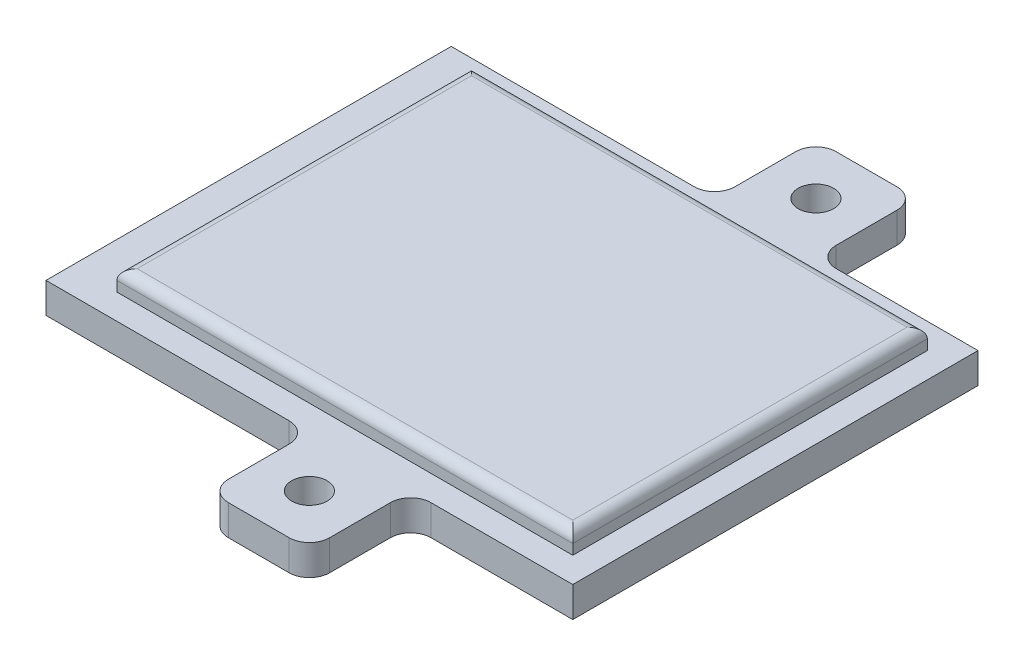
ISO-10303-21;
HEADER;
FILE_DESCRIPTION(('STEP AP214'),'2;1');
FILE_NAME('part.step','',(''),(''),'','','');
FILE_SCHEMA(('AUTOMOTIVE_DESIGN { 1 0 10303 214 1 1 1 1 }'));
ENDSEC;
DATA;
#1=APPLICATION_CONTEXT('core data for automotive mechanical design processes');
#2=APPLICATION_PROTOCOL_DEFINITION('international standard','automotive_design',2000,#1);
#3=PRODUCT_CONTEXT('',#1,'mechanical');
#4=PRODUCT('Part','Part','',(#3));
#5=PRODUCT_RELATED_PRODUCT_CATEGORY('part','',(#4));
#6=PRODUCT_DEFINITION_FORMATION('','',#4);
#7=PRODUCT_DEFINITION_CONTEXT('part definition',#1,'design');
#8=PRODUCT_DEFINITION('design','',#6,#7);
#9=PRODUCT_DEFINITION_SHAPE('','',#8);
#10=(LENGTH_UNIT() NAMED_UNIT(*) SI_UNIT(.MILLI.,.METRE.));
#11=(NAMED_UNIT(*) PLANE_ANGLE_UNIT() SI_UNIT($,.RADIAN.));
#12=(NAMED_UNIT(*) SI_UNIT($,.STERADIAN.) SOLID_ANGLE_UNIT());
#13=UNCERTAINTY_MEASURE_WITH_UNIT(LENGTH_MEASURE(1.E-05),#10,'distance_accuracy_value','');
#14=(GEOMETRIC_REPRESENTATION_CONTEXT(3) GLOBAL_UNCERTAINTY_ASSIGNED_CONTEXT((#13)) GLOBAL_UNIT_ASSIGNED_CONTEXT((#10,
#11,#12)) REPRESENTATION_CONTEXT('',''));
#15=CARTESIAN_POINT('',(0.,0.,0.));
#16=DIRECTION('',(0.,0.,1.));
#17=DIRECTION('',(1.,0.,0.));
#18=AXIS2_PLACEMENT_3D('',#15,#16,#17);
#19=CARTESIAN_POINT('',(0.,3.,0.));
#20=DIRECTION('',(0.,-1.,0.));
#21=DIRECTION('',(0.,0.,-1.));
#22=AXIS2_PLACEMENT_3D('',#19,#20,#21);
#23=PLANE('',#22);
#24=CARTESIAN_POINT('',(-21.,3.,-45.));
#25=DIRECTION('',(0.,1.,0.));
#26=DIRECTION('',(0.,0.,1.));
#27=AXIS2_PLACEMENT_3D('',#24,#25,#26);
#28=CIRCLE('',#27,1.75);
#29=CARTESIAN_POINT('',(-21.,3.,-43.25));
#30=VERTEX_POINT('',#29);
#31=EDGE_CURVE('E798',#30,#30,#28,.T.);
#32=ORIENTED_EDGE('',*,*,#31,.F.);
#33=EDGE_LOOP('',(#32));
#34=FACE_BOUND('',#33,.T.);
#35=CARTESIAN_POINT('',(-21.,3.,5.));
#36=DIRECTION('',(0.,1.,0.));
#37=DIRECTION('',(0.,0.,1.));
#38=AXIS2_PLACEMENT_3D('',#35,#36,#37);
#39=CIRCLE('',#38,1.75);
#40=CARTESIAN_POINT('',(-21.,3.,6.75));
#41=VERTEX_POINT('',#40);
#42=EDGE_CURVE('E797',#41,#41,#39,.T.);
#43=ORIENTED_EDGE('',*,*,#42,.F.);
#44=EDGE_LOOP('',(#43));
#45=FACE_BOUND('',#44,.T.);
#46=DIRECTION('',(0.,0.,-1.));
#47=VECTOR('',#46,1.);
#48=CARTESIAN_POINT('',(-16.,3.,-40.));
#49=LINE('',#48,#47);
#50=CARTESIAN_POINT('',(-16.,3.,-42.));
#51=VERTEX_POINT('',#50);
#52=CARTESIAN_POINT('',(-16.,3.,-48.));
#53=VERTEX_POINT('',#52);
#54=EDGE_CURVE('E288',#51,#53,#49,.T.);
#55=ORIENTED_EDGE('',*,*,#54,.T.);
#56=CARTESIAN_POINT('',(-18.,3.,-48.));
#57=DIRECTION('',(0.,-1.,0.));
#58=DIRECTION('',(0.,0.,-1.));
#59=AXIS2_PLACEMENT_3D('',#56,#57,#58);
#60=CIRCLE('',#59,2.);
#61=CARTESIAN_POINT('',(-18.,3.,-50.));
#62=VERTEX_POINT('',#61);
#63=EDGE_CURVE('E369',#53,#62,#60,.F.);
#64=ORIENTED_EDGE('',*,*,#63,.T.);
#65=DIRECTION('',(1.,0.,0.));
#66=VECTOR('',#65,1.);
#67=CARTESIAN_POINT('',(-26.,3.,-50.));
#68=LINE('',#67,#66);
#69=CARTESIAN_POINT('',(-24.,3.,-50.));
#70=VERTEX_POINT('',#69);
#71=EDGE_CURVE('E285',#70,#62,#68,.T.);
#72=ORIENTED_EDGE('',*,*,#71,.F.);
#73=CARTESIAN_POINT('',(-24.,3.,-48.));
#74=DIRECTION('',(0.,-1.,0.));
#75=DIRECTION('',(0.,0.,-1.));
#76=AXIS2_PLACEMENT_3D('',#73,#74,#75);
#77=CIRCLE('',#76,2.);
#78=CARTESIAN_POINT('',(-26.,3.,-48.));
#79=VERTEX_POINT('',#78);
#80=EDGE_CURVE('E367',#70,#79,#77,.F.);
#81=ORIENTED_EDGE('',*,*,#80,.T.);
#82=DIRECTION('',(0.,0.,-1.));
#83=VECTOR('',#82,1.);
#84=CARTESIAN_POINT('',(-26.,3.,-40.));
#85=LINE('',#84,#83);
#86=CARTESIAN_POINT('',(-26.,3.,-42.));
#87=VERTEX_POINT('',#86);
#88=EDGE_CURVE('E292',#87,#79,#85,.T.);
#89=ORIENTED_EDGE('',*,*,#88,.F.);
#90=CARTESIAN_POINT('',(-28.,3.,-42.));
#91=DIRECTION('',(0.,-1.,0.));
#92=DIRECTION('',(0.,0.,-1.));
#93=AXIS2_PLACEMENT_3D('',#90,#91,#92);
#94=CIRCLE('',#93,2.);
#95=CARTESIAN_POINT('',(-28.,3.,-40.));
#96=VERTEX_POINT('',#95);
#97=EDGE_CURVE('E405',#87,#96,#94,.T.);
#98=ORIENTED_EDGE('',*,*,#97,.T.);
#99=DIRECTION('',(-1.,0.,0.));
#100=VECTOR('',#99,1.);
#101=CARTESIAN_POINT('',(0.,3.,-40.));
#102=LINE('',#101,#100);
#103=CARTESIAN_POINT('',(-52.,3.,-40.));
#104=VERTEX_POINT('',#103);
#105=EDGE_CURVE('E252',#96,#104,#102,.T.);
#106=ORIENTED_EDGE('',*,*,#105,.T.);
#107=DIRECTION('',(0.,0.,-1.));
#108=VECTOR('',#107,1.);
#109=CARTESIAN_POINT('',(-52.,3.,0.));
#110=LINE('',#109,#108);
#111=CARTESIAN_POINT('',(-52.,3.,0.));
#112=VERTEX_POINT('',#111);
#113=EDGE_CURVE('E251',#112,#104,#110,.T.);
#114=ORIENTED_EDGE('',*,*,#113,.F.);
#115=DIRECTION('',(-1.,0.,0.));
#116=VECTOR('',#115,1.);
#117=CARTESIAN_POINT('',(0.,3.,0.));
#118=LINE('',#117,#116);
#119=CARTESIAN_POINT('',(-28.,3.,0.));
#120=VERTEX_POINT('',#119);
#121=EDGE_CURVE('E255',#120,#112,#118,.T.);
#122=ORIENTED_EDGE('',*,*,#121,.F.);
#123=CARTESIAN_POINT('',(-28.,3.,2.));
#124=DIRECTION('',(0.,-1.,0.));
#125=DIRECTION('',(0.,0.,-1.));
#126=AXIS2_PLACEMENT_3D('',#123,#124,#125);
#127=CIRCLE('',#126,2.);
#128=CARTESIAN_POINT('',(-26.,3.,2.));
#129=VERTEX_POINT('',#128);
#130=EDGE_CURVE('E409',#120,#129,#127,.T.);
#131=ORIENTED_EDGE('',*,*,#130,.T.);
#132=DIRECTION('',(0.,0.,1.));
#133=VECTOR('',#132,1.);
#134=CARTESIAN_POINT('',(-26.,3.,0.));
#135=LINE('',#134,#133);
#136=CARTESIAN_POINT('',(-26.,3.,8.));
#137=VERTEX_POINT('',#136);
#138=EDGE_CURVE('E299',#129,#137,#135,.T.);
#139=ORIENTED_EDGE('',*,*,#138,.T.);
#140=CARTESIAN_POINT('',(-24.,3.,8.));
#141=DIRECTION('',(0.,-1.,0.));
#142=DIRECTION('',(0.,0.,-1.));
#143=AXIS2_PLACEMENT_3D('',#140,#141,#142);
#144=CIRCLE('',#143,2.);
#145=CARTESIAN_POINT('',(-24.,3.,10.));
#146=VERTEX_POINT('',#145);
#147=EDGE_CURVE('E365',#137,#146,#144,.F.);
#148=ORIENTED_EDGE('',*,*,#147,.T.);
#149=DIRECTION('',(1.,0.,0.));
#150=VECTOR('',#149,1.);
#151=CARTESIAN_POINT('',(-26.,3.,10.));
#152=LINE('',#151,#150);
#153=CARTESIAN_POINT('',(-18.,3.,10.));
#154=VERTEX_POINT('',#153);
#155=EDGE_CURVE('E304',#146,#154,#152,.T.);
#156=ORIENTED_EDGE('',*,*,#155,.T.);
#157=CARTESIAN_POINT('',(-18.,3.,8.));
#158=DIRECTION('',(0.,-1.,0.));
#159=DIRECTION('',(0.,0.,-1.));
#160=AXIS2_PLACEMENT_3D('',#157,#158,#159);
#161=CIRCLE('',#160,2.);
#162=CARTESIAN_POINT('',(-16.,3.,8.));
#163=VERTEX_POINT('',#162);
#164=EDGE_CURVE('E58',#154,#163,#161,.F.);
#165=ORIENTED_EDGE('',*,*,#164,.T.);
#166=DIRECTION('',(0.,0.,1.));
#167=VECTOR('',#166,1.);
#168=CARTESIAN_POINT('',(-16.,3.,0.));
#169=LINE('',#168,#167);
#170=CARTESIAN_POINT('',(-16.,3.,2.));
#171=VERTEX_POINT('',#170);
#172=EDGE_CURVE('E306',#171,#163,#169,.T.);
#173=ORIENTED_EDGE('',*,*,#172,.F.);
#174=CARTESIAN_POINT('',(-14.,3.,2.));
#175=DIRECTION('',(0.,-1.,0.));
#176=DIRECTION('',(0.,0.,-1.));
#177=AXIS2_PLACEMENT_3D('',#174,#175,#176);
#178=CIRCLE('',#177,2.);
#179=CARTESIAN_POINT('',(-14.,3.,0.));
#180=VERTEX_POINT('',#179);
#181=EDGE_CURVE('E11',#171,#180,#178,.T.);
#182=ORIENTED_EDGE('',*,*,#181,.T.);
#183=CARTESIAN_POINT('',(0.,3.,0.));
#184=VERTEX_POINT('',#183);
#185=EDGE_CURVE('E256',#184,#180,#118,.T.);
#186=ORIENTED_EDGE('',*,*,#185,.F.);
#187=DIRECTION('',(0.,0.,-1.));
#188=VECTOR('',#187,1.);
#189=CARTESIAN_POINT('',(0.,3.,0.));
#190=LINE('',#189,#188);
#191=CARTESIAN_POINT('',(0.,3.,-40.));
#192=VERTEX_POINT('',#191);
#193=EDGE_CURVE('E258',#184,#192,#190,.T.);
#194=ORIENTED_EDGE('',*,*,#193,.T.);
#195=CARTESIAN_POINT('',(-14.,3.,-40.));
#196=VERTEX_POINT('',#195);
#197=EDGE_CURVE('E248',#192,#196,#102,.T.);
#198=ORIENTED_EDGE('',*,*,#197,.T.);
#199=CARTESIAN_POINT('',(-14.,3.,-42.));
#200=DIRECTION('',(0.,-1.,0.));
#201=DIRECTION('',(0.,0.,-1.));
#202=AXIS2_PLACEMENT_3D('',#199,#200,#201);
#203=CIRCLE('',#202,2.);
#204=EDGE_CURVE('E401',#196,#51,#203,.T.);
#205=ORIENTED_EDGE('',*,*,#204,.T.);
#206=EDGE_LOOP('',(#55,#64,#72,#81,#89,#98,#106,#114,#122,#131,#139,#148,#156,#165,#173,#182,
#186,#194,#198,#205));
#207=FACE_BOUND('',#206,.T.);
#208=DIRECTION('',(0.,0.,-1.));
#209=VECTOR('',#208,1.);
#210=CARTESIAN_POINT('',(-2.5,3.,-37.5));
#211=LINE('',#210,#209);
#212=CARTESIAN_POINT('',(-2.5,3.,-2.5));
#213=VERTEX_POINT('',#212);
#214=CARTESIAN_POINT('',(-2.5,3.,-37.5));
#215=VERTEX_POINT('',#214);
#216=EDGE_CURVE('E236',#213,#215,#211,.T.);
#217=ORIENTED_EDGE('',*,*,#216,.F.);
#218=DIRECTION('',(1.,0.,0.));
#219=VECTOR('',#218,1.);
#220=CARTESIAN_POINT('',(-2.5,3.,-2.5));
#221=LINE('',#220,#219);
#222=CARTESIAN_POINT('',(-47.5,3.,-2.5));
#223=VERTEX_POINT('',#222);
#224=EDGE_CURVE('E232',#223,#213,#221,.T.);
#225=ORIENTED_EDGE('',*,*,#224,.F.);
#226=DIRECTION('',(0.,0.,1.));
#227=VECTOR('',#226,1.);
#228=CARTESIAN_POINT('',(-47.5,3.,-37.5));
#229=LINE('',#228,#227);
#230=CARTESIAN_POINT('',(-47.5,3.,-37.5));
#231=VERTEX_POINT('',#230);
#232=EDGE_CURVE('E216',#231,#223,#229,.T.);
#233=ORIENTED_EDGE('',*,*,#232,.F.);
#234=DIRECTION('',(-1.,0.,0.));
#235=VECTOR('',#234,1.);
#236=CARTESIAN_POINT('',(-2.5,3.,-37.5));
#237=LINE('',#236,#235);
#238=EDGE_CURVE('E229',#215,#231,#237,.T.);
#239=ORIENTED_EDGE('',*,*,#238,.F.);
#240=EDGE_LOOP('',(#217,#225,#233,#239));
#241=FACE_BOUND('',#240,.T.);
#242=ADVANCED_FACE('F39',(#34,#45,#207,#241),#23,.F.);
#243=CARTESIAN_POINT('',(-52.,3.,0.));
#244=DIRECTION('',(-1.,0.,0.));
#245=DIRECTION('',(0.,0.,1.));
#246=AXIS2_PLACEMENT_3D('',#243,#244,#245);
#247=PLANE('',#246);
#248=DIRECTION('',(0.,0.,-1.));
#249=VECTOR('',#248,1.);
#250=CARTESIAN_POINT('',(-52.,0.,0.));
#251=LINE('',#250,#249);
#252=CARTESIAN_POINT('',(-52.,0.,0.));
#253=VERTEX_POINT('',#252);
#254=CARTESIAN_POINT('',(-52.,0.,-40.));
#255=VERTEX_POINT('',#254);
#256=EDGE_CURVE('E264',#253,#255,#251,.T.);
#257=ORIENTED_EDGE('',*,*,#256,.F.);
#258=DIRECTION('',(0.,-1.,0.));
#259=VECTOR('',#258,1.);
#260=CARTESIAN_POINT('',(-52.,3.,0.));
#261=LINE('',#260,#259);
#262=EDGE_CURVE('E278',#112,#253,#261,.T.);
#263=ORIENTED_EDGE('',*,*,#262,.F.);
#264=ORIENTED_EDGE('',*,*,#113,.T.);
#265=DIRECTION('',(0.,-1.,0.));
#266=VECTOR('',#265,1.);
#267=CARTESIAN_POINT('',(-52.,3.,-40.));
#268=LINE('',#267,#266);
#269=EDGE_CURVE('E281',#104,#255,#268,.T.);
#270=ORIENTED_EDGE('',*,*,#269,.T.);
#271=EDGE_LOOP('',(#257,#263,#264,#270));
#272=FACE_BOUND('',#271,.T.);
#273=ADVANCED_FACE('F472',(#272),#247,.T.);
#274=CARTESIAN_POINT('',(0.,3.,0.));
#275=DIRECTION('',(-1.,0.,0.));
#276=DIRECTION('',(0.,0.,1.));
#277=AXIS2_PLACEMENT_3D('',#274,#275,#276);
#278=PLANE('',#277);
#279=DIRECTION('',(0.,0.,-1.));
#280=VECTOR('',#279,1.);
#281=CARTESIAN_POINT('',(0.,0.,0.));
#282=LINE('',#281,#280);
#283=CARTESIAN_POINT('',(0.,0.,0.));
#284=VERTEX_POINT('',#283);
#285=CARTESIAN_POINT('',(0.,0.,-40.));
#286=VERTEX_POINT('',#285);
#287=EDGE_CURVE('E272',#284,#286,#282,.T.);
#288=ORIENTED_EDGE('',*,*,#287,.T.);
#289=DIRECTION('',(0.,-1.,0.));
#290=VECTOR('',#289,1.);
#291=CARTESIAN_POINT('',(0.,3.,-40.));
#292=LINE('',#291,#290);
#293=EDGE_CURVE('E260',#192,#286,#292,.T.);
#294=ORIENTED_EDGE('',*,*,#293,.F.);
#295=ORIENTED_EDGE('',*,*,#193,.F.);
#296=DIRECTION('',(0.,-1.,0.));
#297=VECTOR('',#296,1.);
#298=CARTESIAN_POINT('',(0.,3.,0.));
#299=LINE('',#298,#297);
#300=EDGE_CURVE('E276',#184,#284,#299,.T.);
#301=ORIENTED_EDGE('',*,*,#300,.T.);
#302=EDGE_LOOP('',(#288,#294,#295,#301));
#303=FACE_BOUND('',#302,.T.);
#304=ADVANCED_FACE('F428',(#303),#278,.F.);
#305=CARTESIAN_POINT('',(0.,0.,0.));
#306=DIRECTION('',(0.,-1.,0.));
#307=DIRECTION('',(0.,0.,-1.));
#308=AXIS2_PLACEMENT_3D('',#305,#306,#307);
#309=PLANE('',#308);
#310=CARTESIAN_POINT('',(-21.,0.,-45.));
#311=DIRECTION('',(0.,1.,0.));
#312=DIRECTION('',(0.,0.,1.));
#313=AXIS2_PLACEMENT_3D('',#310,#311,#312);
#314=CIRCLE('',#313,1.75);
#315=CARTESIAN_POINT('',(-21.,0.,-43.25));
#316=VERTEX_POINT('',#315);
#317=EDGE_CURVE('E338',#316,#316,#314,.T.);
#318=ORIENTED_EDGE('',*,*,#317,.T.);
#319=EDGE_LOOP('',(#318));
#320=FACE_BOUND('',#319,.T.);
#321=CARTESIAN_POINT('',(-21.,0.,5.));
#322=DIRECTION('',(0.,1.,0.));
#323=DIRECTION('',(0.,0.,1.));
#324=AXIS2_PLACEMENT_3D('',#321,#322,#323);
#325=CIRCLE('',#324,1.75);
#326=CARTESIAN_POINT('',(-21.,0.,6.75));
#327=VERTEX_POINT('',#326);
#328=EDGE_CURVE('E794',#327,#327,#325,.T.);
#329=ORIENTED_EDGE('',*,*,#328,.T.);
#330=EDGE_LOOP('',(#329));
#331=FACE_BOUND('',#330,.T.);
#332=DIRECTION('',(1.,0.,0.));
#333=VECTOR('',#332,1.);
#334=CARTESIAN_POINT('',(-26.,0.,-50.));
#335=LINE('',#334,#333);
#336=CARTESIAN_POINT('',(-24.,0.,-50.));
#337=VERTEX_POINT('',#336);
#338=CARTESIAN_POINT('',(-18.,0.,-50.));
#339=VERTEX_POINT('',#338);
#340=EDGE_CURVE('E295',#337,#339,#335,.T.);
#341=ORIENTED_EDGE('',*,*,#340,.T.);
#342=CARTESIAN_POINT('',(-18.,0.,-48.));
#343=DIRECTION('',(0.,-1.,0.));
#344=DIRECTION('',(0.,0.,-1.));
#345=AXIS2_PLACEMENT_3D('',#342,#343,#344);
#346=CIRCLE('',#345,2.);
#347=CARTESIAN_POINT('',(-16.,0.,-48.));
#348=VERTEX_POINT('',#347);
#349=EDGE_CURVE('E362',#339,#348,#346,.T.);
#350=ORIENTED_EDGE('',*,*,#349,.T.);
#351=DIRECTION('',(0.,0.,-1.));
#352=VECTOR('',#351,1.);
#353=CARTESIAN_POINT('',(-16.,0.,-40.));
#354=LINE('',#353,#352);
#355=CARTESIAN_POINT('',(-16.,0.,-42.));
#356=VERTEX_POINT('',#355);
#357=EDGE_CURVE('E298',#356,#348,#354,.T.);
#358=ORIENTED_EDGE('',*,*,#357,.F.);
#359=CARTESIAN_POINT('',(-14.,0.,-42.));
#360=DIRECTION('',(0.,-1.,0.));
#361=DIRECTION('',(0.,0.,-1.));
#362=AXIS2_PLACEMENT_3D('',#359,#360,#361);
#363=CIRCLE('',#362,2.);
#364=CARTESIAN_POINT('',(-14.,0.,-40.));
#365=VERTEX_POINT('',#364);
#366=EDGE_CURVE('E399',#356,#365,#363,.F.);
#367=ORIENTED_EDGE('',*,*,#366,.T.);
#368=DIRECTION('',(-1.,0.,0.));
#369=VECTOR('',#368,1.);
#370=CARTESIAN_POINT('',(0.,0.,-40.));
#371=LINE('',#370,#369);
#372=EDGE_CURVE('E261',#286,#365,#371,.T.);
#373=ORIENTED_EDGE('',*,*,#372,.F.);
#374=ORIENTED_EDGE('',*,*,#287,.F.);
#375=DIRECTION('',(-1.,0.,0.));
#376=VECTOR('',#375,1.);
#377=CARTESIAN_POINT('',(0.,0.,0.));
#378=LINE('',#377,#376);
#379=CARTESIAN_POINT('',(-14.,0.,0.));
#380=VERTEX_POINT('',#379);
#381=EDGE_CURVE('E269',#284,#380,#378,.T.);
#382=ORIENTED_EDGE('',*,*,#381,.T.);
#383=CARTESIAN_POINT('',(-14.,0.,2.));
#384=DIRECTION('',(0.,-1.,0.));
#385=DIRECTION('',(0.,0.,-1.));
#386=AXIS2_PLACEMENT_3D('',#383,#384,#385);
#387=CIRCLE('',#386,2.);
#388=CARTESIAN_POINT('',(-16.,0.,2.));
#389=VERTEX_POINT('',#388);
#390=EDGE_CURVE('E47',#380,#389,#387,.F.);
#391=ORIENTED_EDGE('',*,*,#390,.T.);
#392=DIRECTION('',(0.,0.,1.));
#393=VECTOR('',#392,1.);
#394=CARTESIAN_POINT('',(-16.,0.,0.));
#395=LINE('',#394,#393);
#396=CARTESIAN_POINT('',(-16.,0.,8.));
#397=VERTEX_POINT('',#396);
#398=EDGE_CURVE('E313',#389,#397,#395,.T.);
#399=ORIENTED_EDGE('',*,*,#398,.T.);
#400=CARTESIAN_POINT('',(-18.,0.,8.));
#401=DIRECTION('',(0.,-1.,0.));
#402=DIRECTION('',(0.,0.,-1.));
#403=AXIS2_PLACEMENT_3D('',#400,#401,#402);
#404=CIRCLE('',#403,2.);
#405=CARTESIAN_POINT('',(-18.,0.,10.));
#406=VERTEX_POINT('',#405);
#407=EDGE_CURVE('E356',#397,#406,#404,.T.);
#408=ORIENTED_EDGE('',*,*,#407,.T.);
#409=DIRECTION('',(1.,0.,0.));
#410=VECTOR('',#409,1.);
#411=CARTESIAN_POINT('',(-26.,0.,10.));
#412=LINE('',#411,#410);
#413=CARTESIAN_POINT('',(-24.,0.,10.));
#414=VERTEX_POINT('',#413);
#415=EDGE_CURVE('E247',#414,#406,#412,.T.);
#416=ORIENTED_EDGE('',*,*,#415,.F.);
#417=CARTESIAN_POINT('',(-24.,0.,8.));
#418=DIRECTION('',(0.,-1.,0.));
#419=DIRECTION('',(0.,0.,-1.));
#420=AXIS2_PLACEMENT_3D('',#417,#418,#419);
#421=CIRCLE('',#420,2.);
#422=CARTESIAN_POINT('',(-26.,0.,8.));
#423=VERTEX_POINT('',#422);
#424=EDGE_CURVE('E358',#414,#423,#421,.T.);
#425=ORIENTED_EDGE('',*,*,#424,.T.);
#426=DIRECTION('',(0.,0.,1.));
#427=VECTOR('',#426,1.);
#428=CARTESIAN_POINT('',(-26.,0.,0.));
#429=LINE('',#428,#427);
#430=CARTESIAN_POINT('',(-26.,0.,2.));
#431=VERTEX_POINT('',#430);
#432=EDGE_CURVE('E307',#431,#423,#429,.T.);
#433=ORIENTED_EDGE('',*,*,#432,.F.);
#434=CARTESIAN_POINT('',(-28.,0.,2.));
#435=DIRECTION('',(0.,-1.,0.));
#436=DIRECTION('',(0.,0.,-1.));
#437=AXIS2_PLACEMENT_3D('',#434,#435,#436);
#438=CIRCLE('',#437,2.);
#439=CARTESIAN_POINT('',(-28.,0.,0.));
#440=VERTEX_POINT('',#439);
#441=EDGE_CURVE('E407',#431,#440,#438,.F.);
#442=ORIENTED_EDGE('',*,*,#441,.T.);
#443=EDGE_CURVE('E268',#440,#253,#378,.T.);
#444=ORIENTED_EDGE('',*,*,#443,.T.);
#445=ORIENTED_EDGE('',*,*,#256,.T.);
#446=CARTESIAN_POINT('',(-28.,0.,-40.));
#447=VERTEX_POINT('',#446);
#448=EDGE_CURVE('E265',#447,#255,#371,.T.);
#449=ORIENTED_EDGE('',*,*,#448,.F.);
#450=CARTESIAN_POINT('',(-28.,0.,-42.));
#451=DIRECTION('',(0.,-1.,0.));
#452=DIRECTION('',(0.,0.,-1.));
#453=AXIS2_PLACEMENT_3D('',#450,#451,#452);
#454=CIRCLE('',#453,2.);
#455=CARTESIAN_POINT('',(-26.,0.,-42.));
#456=VERTEX_POINT('',#455);
#457=EDGE_CURVE('E403',#447,#456,#454,.F.);
#458=ORIENTED_EDGE('',*,*,#457,.T.);
#459=DIRECTION('',(0.,0.,-1.));
#460=VECTOR('',#459,1.);
#461=CARTESIAN_POINT('',(-26.,0.,-40.));
#462=LINE('',#461,#460);
#463=CARTESIAN_POINT('',(-26.,0.,-48.));
#464=VERTEX_POINT('',#463);
#465=EDGE_CURVE('E289',#456,#464,#462,.T.);
#466=ORIENTED_EDGE('',*,*,#465,.T.);
#467=CARTESIAN_POINT('',(-24.,0.,-48.));
#468=DIRECTION('',(0.,-1.,0.));
#469=DIRECTION('',(0.,0.,-1.));
#470=AXIS2_PLACEMENT_3D('',#467,#468,#469);
#471=CIRCLE('',#470,2.);
#472=EDGE_CURVE('E360',#464,#337,#471,.T.);
#473=ORIENTED_EDGE('',*,*,#472,.T.);
#474=EDGE_LOOP('',(#341,#350,#358,#367,#373,#374,#382,#391,#399,#408,#416,#425,#433,#442,#444,
#445,#449,#458,#466,#473));
#475=FACE_BOUND('',#474,.T.);
#476=ADVANCED_FACE('F412',(#320,#331,#475),#309,.T.);
#477=CARTESIAN_POINT('',(0.,3.,0.));
#478=DIRECTION('',(0.,0.,1.));
#479=DIRECTION('',(1.,0.,0.));
#480=AXIS2_PLACEMENT_3D('',#477,#478,#479);
#481=PLANE('',#480);
#482=ORIENTED_EDGE('',*,*,#185,.T.);
#483=DIRECTION('',(0.,-1.,0.));
#484=VECTOR('',#483,1.);
#485=CARTESIAN_POINT('',(-14.,0.,0.));
#486=LINE('',#485,#484);
#487=EDGE_CURVE('E396',#180,#380,#486,.T.);
#488=ORIENTED_EDGE('',*,*,#487,.T.);
#489=ORIENTED_EDGE('',*,*,#381,.F.);
#490=ORIENTED_EDGE('',*,*,#300,.F.);
#491=EDGE_LOOP('',(#482,#488,#489,#490));
#492=FACE_BOUND('',#491,.T.);
#493=ADVANCED_FACE('F422',(#492),#481,.T.);
#494=ORIENTED_EDGE('',*,*,#443,.F.);
#495=DIRECTION('',(0.,-1.,0.));
#496=VECTOR('',#495,1.);
#497=CARTESIAN_POINT('',(-28.,3.,0.));
#498=LINE('',#497,#496);
#499=EDGE_CURVE('E389',#440,#120,#498,.F.);
#500=ORIENTED_EDGE('',*,*,#499,.T.);
#501=ORIENTED_EDGE('',*,*,#121,.T.);
#502=ORIENTED_EDGE('',*,*,#262,.T.);
#503=EDGE_LOOP('',(#494,#500,#501,#502));
#504=FACE_BOUND('',#503,.T.);
#505=ADVANCED_FACE('F522',(#504),#481,.T.);
#506=CARTESIAN_POINT('',(0.,3.,-40.));
#507=DIRECTION('',(0.,0.,1.));
#508=DIRECTION('',(1.,0.,0.));
#509=AXIS2_PLACEMENT_3D('',#506,#507,#508);
#510=PLANE('',#509);
#511=ORIENTED_EDGE('',*,*,#105,.F.);
#512=DIRECTION('',(0.,-1.,0.));
#513=VECTOR('',#512,1.);
#514=CARTESIAN_POINT('',(-28.,3.,-40.));
#515=LINE('',#514,#513);
#516=EDGE_CURVE('E376',#96,#447,#515,.T.);
#517=ORIENTED_EDGE('',*,*,#516,.T.);
#518=ORIENTED_EDGE('',*,*,#448,.T.);
#519=ORIENTED_EDGE('',*,*,#269,.F.);
#520=EDGE_LOOP('',(#511,#517,#518,#519));
#521=FACE_BOUND('',#520,.T.);
#522=ADVANCED_FACE('F467',(#521),#510,.F.);
#523=ORIENTED_EDGE('',*,*,#372,.T.);
#524=DIRECTION('',(0.,-1.,0.));
#525=VECTOR('',#524,1.);
#526=CARTESIAN_POINT('',(-14.,3.,-40.));
#527=LINE('',#526,#525);
#528=EDGE_CURVE('E349',#365,#196,#527,.F.);
#529=ORIENTED_EDGE('',*,*,#528,.T.);
#530=ORIENTED_EDGE('',*,*,#197,.F.);
#531=ORIENTED_EDGE('',*,*,#293,.T.);
#532=EDGE_LOOP('',(#523,#529,#530,#531));
#533=FACE_BOUND('',#532,.T.);
#534=ADVANCED_FACE('F431',(#533),#510,.F.);
#535=CARTESIAN_POINT('',(-26.,3.,10.));
#536=DIRECTION('',(0.,0.,-1.));
#537=DIRECTION('',(-1.,0.,0.));
#538=AXIS2_PLACEMENT_3D('',#535,#536,#537);
#539=PLANE('',#538);
#540=ORIENTED_EDGE('',*,*,#155,.F.);
#541=DIRECTION('',(0.,-1.,0.));
#542=VECTOR('',#541,1.);
#543=CARTESIAN_POINT('',(-24.,3.,10.));
#544=LINE('',#543,#542);
#545=EDGE_CURVE('E381',#146,#414,#544,.T.);
#546=ORIENTED_EDGE('',*,*,#545,.T.);
#547=ORIENTED_EDGE('',*,*,#415,.T.);
#548=DIRECTION('',(0.,-1.,0.));
#549=VECTOR('',#548,1.);
#550=CARTESIAN_POINT('',(-18.,3.,10.));
#551=LINE('',#550,#549);
#552=EDGE_CURVE('E379',#406,#154,#551,.F.);
#553=ORIENTED_EDGE('',*,*,#552,.T.);
#554=EDGE_LOOP('',(#540,#546,#547,#553));
#555=FACE_BOUND('',#554,.T.);
#556=ADVANCED_FACE('F493',(#555),#539,.F.);
#557=CARTESIAN_POINT('',(-16.,3.,0.));
#558=DIRECTION('',(1.,0.,0.));
#559=DIRECTION('',(0.,0.,-1.));
#560=AXIS2_PLACEMENT_3D('',#557,#558,#559);
#561=PLANE('',#560);
#562=ORIENTED_EDGE('',*,*,#172,.T.);
#563=DIRECTION('',(0.,-1.,0.));
#564=VECTOR('',#563,1.);
#565=CARTESIAN_POINT('',(-16.,0.,8.));
#566=LINE('',#565,#564);
#567=EDGE_CURVE('E393',#163,#397,#566,.T.);
#568=ORIENTED_EDGE('',*,*,#567,.T.);
#569=ORIENTED_EDGE('',*,*,#398,.F.);
#570=DIRECTION('',(0.,-1.,0.));
#571=VECTOR('',#570,1.);
#572=CARTESIAN_POINT('',(-16.,3.,2.));
#573=LINE('',#572,#571);
#574=EDGE_CURVE('E391',#389,#171,#573,.F.);
#575=ORIENTED_EDGE('',*,*,#574,.T.);
#576=EDGE_LOOP('',(#562,#568,#569,#575));
#577=FACE_BOUND('',#576,.T.);
#578=ADVANCED_FACE('F419',(#577),#561,.T.);
#579=CARTESIAN_POINT('',(-26.,3.,0.));
#580=DIRECTION('',(1.,0.,0.));
#581=DIRECTION('',(0.,0.,-1.));
#582=AXIS2_PLACEMENT_3D('',#579,#580,#581);
#583=PLANE('',#582);
#584=ORIENTED_EDGE('',*,*,#432,.T.);
#585=DIRECTION('',(0.,-1.,0.));
#586=VECTOR('',#585,1.);
#587=CARTESIAN_POINT('',(-26.,3.,8.));
#588=LINE('',#587,#586);
#589=EDGE_CURVE('E387',#423,#137,#588,.F.);
#590=ORIENTED_EDGE('',*,*,#589,.T.);
#591=ORIENTED_EDGE('',*,*,#138,.F.);
#592=DIRECTION('',(0.,-1.,0.));
#593=VECTOR('',#592,1.);
#594=CARTESIAN_POINT('',(-26.,3.,2.));
#595=LINE('',#594,#593);
#596=EDGE_CURVE('E384',#129,#431,#595,.T.);
#597=ORIENTED_EDGE('',*,*,#596,.T.);
#598=EDGE_LOOP('',(#584,#590,#591,#597));
#599=FACE_BOUND('',#598,.T.);
#600=ADVANCED_FACE('F483',(#599),#583,.F.);
#601=CARTESIAN_POINT('',(-26.,3.,-50.));
#602=DIRECTION('',(0.,0.,-1.));
#603=DIRECTION('',(-1.,0.,0.));
#604=AXIS2_PLACEMENT_3D('',#601,#602,#603);
#605=PLANE('',#604);
#606=ORIENTED_EDGE('',*,*,#71,.T.);
#607=DIRECTION('',(0.,-1.,0.));
#608=VECTOR('',#607,1.);
#609=CARTESIAN_POINT('',(-18.,0.,-50.));
#610=LINE('',#609,#608);
#611=EDGE_CURVE('E353',#62,#339,#610,.T.);
#612=ORIENTED_EDGE('',*,*,#611,.T.);
#613=ORIENTED_EDGE('',*,*,#340,.F.);
#614=DIRECTION('',(0.,-1.,0.));
#615=VECTOR('',#614,1.);
#616=CARTESIAN_POINT('',(-24.,3.,-50.));
#617=LINE('',#616,#615);
#618=EDGE_CURVE('E351',#337,#70,#617,.F.);
#619=ORIENTED_EDGE('',*,*,#618,.T.);
#620=EDGE_LOOP('',(#606,#612,#613,#619));
#621=FACE_BOUND('',#620,.T.);
#622=ADVANCED_FACE('F448',(#621),#605,.T.);
#623=CARTESIAN_POINT('',(-26.,3.,-40.));
#624=DIRECTION('',(-1.,0.,0.));
#625=DIRECTION('',(0.,0.,1.));
#626=AXIS2_PLACEMENT_3D('',#623,#624,#625);
#627=PLANE('',#626);
#628=ORIENTED_EDGE('',*,*,#88,.T.);
#629=DIRECTION('',(0.,-1.,0.));
#630=VECTOR('',#629,1.);
#631=CARTESIAN_POINT('',(-26.,3.,-48.));
#632=LINE('',#631,#630);
#633=EDGE_CURVE('E373',#79,#464,#632,.T.);
#634=ORIENTED_EDGE('',*,*,#633,.T.);
#635=ORIENTED_EDGE('',*,*,#465,.F.);
#636=DIRECTION('',(0.,-1.,0.));
#637=VECTOR('',#636,1.);
#638=CARTESIAN_POINT('',(-26.,3.,-42.));
#639=LINE('',#638,#637);
#640=EDGE_CURVE('E371',#456,#87,#639,.F.);
#641=ORIENTED_EDGE('',*,*,#640,.T.);
#642=EDGE_LOOP('',(#628,#634,#635,#641));
#643=FACE_BOUND('',#642,.T.);
#644=ADVANCED_FACE('F457',(#643),#627,.T.);
#645=CARTESIAN_POINT('',(-16.,3.,-40.));
#646=DIRECTION('',(-1.,0.,0.));
#647=DIRECTION('',(0.,0.,1.));
#648=AXIS2_PLACEMENT_3D('',#645,#646,#647);
#649=PLANE('',#648);
#650=ORIENTED_EDGE('',*,*,#54,.F.);
#651=DIRECTION('',(0.,-1.,0.));
#652=VECTOR('',#651,1.);
#653=CARTESIAN_POINT('',(-16.,0.,-42.));
#654=LINE('',#653,#652);
#655=EDGE_CURVE('E346',#51,#356,#654,.T.);
#656=ORIENTED_EDGE('',*,*,#655,.T.);
#657=ORIENTED_EDGE('',*,*,#357,.T.);
#658=DIRECTION('',(0.,-1.,0.));
#659=VECTOR('',#658,1.);
#660=CARTESIAN_POINT('',(-16.,3.,-48.));
#661=LINE('',#660,#659);
#662=EDGE_CURVE('E334',#348,#53,#661,.F.);
#663=ORIENTED_EDGE('',*,*,#662,.T.);
#664=EDGE_LOOP('',(#650,#656,#657,#663));
#665=FACE_BOUND('',#664,.T.);
#666=ADVANCED_FACE('F439',(#665),#649,.F.);
#667=CARTESIAN_POINT('',(-2.5,5.,-37.5));
#668=DIRECTION('',(-1.,0.,0.));
#669=DIRECTION('',(0.,0.,1.));
#670=AXIS2_PLACEMENT_3D('',#667,#668,#669);
#671=PLANE('',#670);
#672=DIRECTION('',(0.,-1.,0.));
#673=VECTOR('',#672,1.);
#674=CARTESIAN_POINT('',(-2.5,5.,-37.5));
#675=LINE('',#674,#673);
#676=CARTESIAN_POINT('',(-2.5,4.,-37.5));
#677=VERTEX_POINT('',#676);
#678=EDGE_CURVE('E222',#677,#215,#675,.T.);
#679=ORIENTED_EDGE('',*,*,#678,.F.);
#680=DIRECTION('',(0.,0.,-1.));
#681=VECTOR('',#680,1.);
#682=CARTESIAN_POINT('',(-2.5,4.,-37.5));
#683=LINE('',#682,#681);
#684=CARTESIAN_POINT('',(-2.5,4.,-2.5));
#685=VERTEX_POINT('',#684);
#686=EDGE_CURVE('E332',#677,#685,#683,.F.);
#687=ORIENTED_EDGE('',*,*,#686,.T.);
#688=DIRECTION('',(0.,-1.,0.));
#689=VECTOR('',#688,1.);
#690=CARTESIAN_POINT('',(-2.5,5.,-2.5));
#691=LINE('',#690,#689);
#692=EDGE_CURVE('E243',#685,#213,#691,.T.);
#693=ORIENTED_EDGE('',*,*,#692,.T.);
#694=ORIENTED_EDGE('',*,*,#216,.T.);
#695=EDGE_LOOP('',(#679,#687,#693,#694));
#696=FACE_BOUND('',#695,.T.);
#697=ADVANCED_FACE('F516',(#696),#671,.F.);
#698=CARTESIAN_POINT('',(-2.5,5.,-37.5));
#699=DIRECTION('',(0.,0.,1.));
#700=DIRECTION('',(1.,0.,0.));
#701=AXIS2_PLACEMENT_3D('',#698,#699,#700);
#702=PLANE('',#701);
#703=DIRECTION('',(0.,-1.,0.));
#704=VECTOR('',#703,1.);
#705=CARTESIAN_POINT('',(-47.5,5.,-37.5));
#706=LINE('',#705,#704);
#707=CARTESIAN_POINT('',(-47.5,4.,-37.5));
#708=VERTEX_POINT('',#707);
#709=EDGE_CURVE('E212',#708,#231,#706,.T.);
#710=ORIENTED_EDGE('',*,*,#709,.F.);
#711=DIRECTION('',(-1.,0.,0.));
#712=VECTOR('',#711,1.);
#713=CARTESIAN_POINT('',(-2.5,4.,-37.5));
#714=LINE('',#713,#712);
#715=EDGE_CURVE('E330',#708,#677,#714,.F.);
#716=ORIENTED_EDGE('',*,*,#715,.T.);
#717=ORIENTED_EDGE('',*,*,#678,.T.);
#718=ORIENTED_EDGE('',*,*,#238,.T.);
#719=EDGE_LOOP('',(#710,#716,#717,#718));
#720=FACE_BOUND('',#719,.T.);
#721=ADVANCED_FACE('F234',(#720),#702,.F.);
#722=CARTESIAN_POINT('',(-47.5,5.,-37.5));
#723=DIRECTION('',(1.,0.,0.));
#724=DIRECTION('',(0.,0.,-1.));
#725=AXIS2_PLACEMENT_3D('',#722,#723,#724);
#726=PLANE('',#725);
#727=DIRECTION('',(0.,-1.,0.));
#728=VECTOR('',#727,1.);
#729=CARTESIAN_POINT('',(-47.5,5.,-2.5));
#730=LINE('',#729,#728);
#731=CARTESIAN_POINT('',(-47.5,4.,-2.5));
#732=VERTEX_POINT('',#731);
#733=EDGE_CURVE('E223',#732,#223,#730,.T.);
#734=ORIENTED_EDGE('',*,*,#733,.F.);
#735=DIRECTION('',(0.,0.,1.));
#736=VECTOR('',#735,1.);
#737=CARTESIAN_POINT('',(-47.5,4.,-37.5));
#738=LINE('',#737,#736);
#739=EDGE_CURVE('E218',#732,#708,#738,.F.);
#740=ORIENTED_EDGE('',*,*,#739,.T.);
#741=ORIENTED_EDGE('',*,*,#709,.T.);
#742=ORIENTED_EDGE('',*,*,#232,.T.);
#743=EDGE_LOOP('',(#734,#740,#741,#742));
#744=FACE_BOUND('',#743,.T.);
#745=ADVANCED_FACE('F215',(#744),#726,.F.);
#746=CARTESIAN_POINT('',(-2.5,5.,-2.5));
#747=DIRECTION('',(0.,0.,-1.));
#748=DIRECTION('',(-1.,0.,0.));
#749=AXIS2_PLACEMENT_3D('',#746,#747,#748);
#750=PLANE('',#749);
#751=ORIENTED_EDGE('',*,*,#692,.F.);
#752=DIRECTION('',(1.,0.,0.));
#753=VECTOR('',#752,1.);
#754=CARTESIAN_POINT('',(-2.5,4.,-2.5));
#755=LINE('',#754,#753);
#756=EDGE_CURVE('E326',#685,#732,#755,.F.);
#757=ORIENTED_EDGE('',*,*,#756,.T.);
#758=ORIENTED_EDGE('',*,*,#733,.T.);
#759=ORIENTED_EDGE('',*,*,#224,.T.);
#760=EDGE_LOOP('',(#751,#757,#758,#759));
#761=FACE_BOUND('',#760,.T.);
#762=ADVANCED_FACE('F650',(#761),#750,.F.);
#763=CARTESIAN_POINT('',(0.,5.,0.));
#764=DIRECTION('',(0.,-1.,0.));
#765=DIRECTION('',(0.,0.,-1.));
#766=AXIS2_PLACEMENT_3D('',#763,#764,#765);
#767=PLANE('',#766);
#768=DIRECTION('',(0.,0.,1.));
#769=VECTOR('',#768,1.);
#770=CARTESIAN_POINT('',(-46.5,5.,0.));
#771=LINE('',#770,#769);
#772=CARTESIAN_POINT('',(-46.5,5.,-36.5));
#773=VERTEX_POINT('',#772);
#774=CARTESIAN_POINT('',(-46.5,5.,-3.5));
#775=VERTEX_POINT('',#774);
#776=EDGE_CURVE('E321',#773,#775,#771,.T.);
#777=ORIENTED_EDGE('',*,*,#776,.T.);
#778=DIRECTION('',(1.,0.,0.));
#779=VECTOR('',#778,1.);
#780=CARTESIAN_POINT('',(0.,5.,-3.5));
#781=LINE('',#780,#779);
#782=CARTESIAN_POINT('',(-3.5,5.,-3.5));
#783=VERTEX_POINT('',#782);
#784=EDGE_CURVE('E323',#775,#783,#781,.T.);
#785=ORIENTED_EDGE('',*,*,#784,.T.);
#786=DIRECTION('',(0.,0.,-1.));
#787=VECTOR('',#786,1.);
#788=CARTESIAN_POINT('',(-3.5,5.,0.));
#789=LINE('',#788,#787);
#790=CARTESIAN_POINT('',(-3.5,5.,-36.5));
#791=VERTEX_POINT('',#790);
#792=EDGE_CURVE('E284',#783,#791,#789,.T.);
#793=ORIENTED_EDGE('',*,*,#792,.T.);
#794=DIRECTION('',(-1.,0.,0.));
#795=VECTOR('',#794,1.);
#796=CARTESIAN_POINT('',(0.,5.,-36.5));
#797=LINE('',#796,#795);
#798=EDGE_CURVE('E319',#791,#773,#797,.T.);
#799=ORIENTED_EDGE('',*,*,#798,.T.);
#800=EDGE_LOOP('',(#777,#785,#793,#799));
#801=FACE_BOUND('',#800,.T.);
#802=ADVANCED_FACE('F555',(#801),#767,.F.);
#803=CARTESIAN_POINT('',(0.,4.,-36.5));
#804=DIRECTION('',(-1.,0.,0.));
#805=DIRECTION('',(0.,0.,1.));
#806=AXIS2_PLACEMENT_3D('',#803,#804,#805);
#807=CYLINDRICAL_SURFACE('',#806,1.);
#808=CARTESIAN_POINT('',(-3.5,4.,-36.5));
#809=DIRECTION('',(-0.707106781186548,0.,-0.707106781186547));
#810=DIRECTION('',(0.707106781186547,0.,-0.707106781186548));
#811=AXIS2_PLACEMENT_3D('',#808,#809,#810);
#812=ELLIPSE('',#811,1.41421356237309,1.);
#813=EDGE_CURVE('E340',#677,#791,#812,.F.);
#814=ORIENTED_EDGE('',*,*,#813,.F.);
#815=ORIENTED_EDGE('',*,*,#715,.F.);
#816=CARTESIAN_POINT('',(-46.5,4.,-36.5));
#817=DIRECTION('',(-0.707106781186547,0.,0.707106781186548));
#818=DIRECTION('',(-0.707106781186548,0.,-0.707106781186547));
#819=AXIS2_PLACEMENT_3D('',#816,#817,#818);
#820=ELLIPSE('',#819,1.4142135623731,1.);
#821=EDGE_CURVE('E238',#773,#708,#820,.T.);
#822=ORIENTED_EDGE('',*,*,#821,.F.);
#823=ORIENTED_EDGE('',*,*,#798,.F.);
#824=EDGE_LOOP('',(#814,#815,#822,#823));
#825=FACE_BOUND('',#824,.T.);
#826=ADVANCED_FACE('F551',(#825),#807,.T.);
#827=CARTESIAN_POINT('',(-46.5,4.,0.));
#828=DIRECTION('',(0.,0.,1.));
#829=DIRECTION('',(1.,0.,0.));
#830=AXIS2_PLACEMENT_3D('',#827,#828,#829);
#831=CYLINDRICAL_SURFACE('',#830,1.);
#832=ORIENTED_EDGE('',*,*,#821,.T.);
#833=ORIENTED_EDGE('',*,*,#739,.F.);
#834=CARTESIAN_POINT('',(-46.5,4.,-3.5));
#835=DIRECTION('',(0.707106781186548,0.,0.707106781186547));
#836=DIRECTION('',(-0.707106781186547,0.,0.707106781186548));
#837=AXIS2_PLACEMENT_3D('',#834,#835,#836);
#838=ELLIPSE('',#837,1.41421356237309,1.);
#839=EDGE_CURVE('E337',#775,#732,#838,.T.);
#840=ORIENTED_EDGE('',*,*,#839,.F.);
#841=ORIENTED_EDGE('',*,*,#776,.F.);
#842=EDGE_LOOP('',(#832,#833,#840,#841));
#843=FACE_BOUND('',#842,.T.);
#844=ADVANCED_FACE('F547',(#843),#831,.T.);
#845=CARTESIAN_POINT('',(-3.5,4.,0.));
#846=DIRECTION('',(0.,0.,-1.));
#847=DIRECTION('',(-1.,0.,0.));
#848=AXIS2_PLACEMENT_3D('',#845,#846,#847);
#849=CYLINDRICAL_SURFACE('',#848,1.);
#850=ORIENTED_EDGE('',*,*,#813,.T.);
#851=ORIENTED_EDGE('',*,*,#792,.F.);
#852=CARTESIAN_POINT('',(-3.5,4.,-3.5));
#853=DIRECTION('',(0.707106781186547,0.,-0.707106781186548));
#854=DIRECTION('',(-0.707106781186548,0.,-0.707106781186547));
#855=AXIS2_PLACEMENT_3D('',#852,#853,#854);
#856=ELLIPSE('',#855,1.41421356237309,1.);
#857=EDGE_CURVE('E335',#685,#783,#856,.F.);
#858=ORIENTED_EDGE('',*,*,#857,.F.);
#859=ORIENTED_EDGE('',*,*,#686,.F.);
#860=EDGE_LOOP('',(#850,#851,#858,#859));
#861=FACE_BOUND('',#860,.T.);
#862=ADVANCED_FACE('F543',(#861),#849,.T.);
#863=CARTESIAN_POINT('',(0.,4.,-3.5));
#864=DIRECTION('',(1.,0.,0.));
#865=DIRECTION('',(0.,0.,-1.));
#866=AXIS2_PLACEMENT_3D('',#863,#864,#865);
#867=CYLINDRICAL_SURFACE('',#866,1.);
#868=ORIENTED_EDGE('',*,*,#839,.T.);
#869=ORIENTED_EDGE('',*,*,#756,.F.);
#870=ORIENTED_EDGE('',*,*,#857,.T.);
#871=ORIENTED_EDGE('',*,*,#784,.F.);
#872=EDGE_LOOP('',(#868,#869,#870,#871));
#873=FACE_BOUND('',#872,.T.);
#874=ADVANCED_FACE('F539',(#873),#867,.T.);
#875=CARTESIAN_POINT('',(-21.,0.,5.));
#876=DIRECTION('',(0.,1.,0.));
#877=DIRECTION('',(0.,0.,1.));
#878=AXIS2_PLACEMENT_3D('',#875,#876,#877);
#879=CYLINDRICAL_SURFACE('',#878,1.75);
#880=ORIENTED_EDGE('',*,*,#328,.F.);
#881=EDGE_LOOP('',(#880));
#882=FACE_BOUND('',#881,.T.);
#883=ORIENTED_EDGE('',*,*,#42,.T.);
#884=EDGE_LOOP('',(#883));
#885=FACE_BOUND('',#884,.T.);
#886=ADVANCED_FACE('F542',(#882,#885),#879,.F.);
#887=CARTESIAN_POINT('',(-21.,0.,-45.));
#888=DIRECTION('',(0.,1.,0.));
#889=DIRECTION('',(0.,0.,1.));
#890=AXIS2_PLACEMENT_3D('',#887,#888,#889);
#891=CYLINDRICAL_SURFACE('',#890,1.75);
#892=ORIENTED_EDGE('',*,*,#317,.F.);
#893=EDGE_LOOP('',(#892));
#894=FACE_BOUND('',#893,.T.);
#895=ORIENTED_EDGE('',*,*,#31,.T.);
#896=EDGE_LOOP('',(#895));
#897=FACE_BOUND('',#896,.T.);
#898=ADVANCED_FACE('F559',(#894,#897),#891,.F.);
#899=CARTESIAN_POINT('',(-14.,3.,-42.));
#900=DIRECTION('',(0.,1.,0.));
#901=DIRECTION('',(0.,0.,1.));
#902=AXIS2_PLACEMENT_3D('',#899,#900,#901);
#903=CYLINDRICAL_SURFACE('',#902,2.);
#904=ORIENTED_EDGE('',*,*,#204,.F.);
#905=ORIENTED_EDGE('',*,*,#528,.F.);
#906=ORIENTED_EDGE('',*,*,#366,.F.);
#907=ORIENTED_EDGE('',*,*,#655,.F.);
#908=EDGE_LOOP('',(#904,#905,#906,#907));
#909=FACE_BOUND('',#908,.T.);
#910=ADVANCED_FACE('F434',(#909),#903,.F.);
#911=CARTESIAN_POINT('',(-18.,3.,-48.));
#912=DIRECTION('',(0.,1.,0.));
#913=DIRECTION('',(0.,0.,1.));
#914=AXIS2_PLACEMENT_3D('',#911,#912,#913);
#915=CYLINDRICAL_SURFACE('',#914,2.);
#916=ORIENTED_EDGE('',*,*,#63,.F.);
#917=ORIENTED_EDGE('',*,*,#662,.F.);
#918=ORIENTED_EDGE('',*,*,#349,.F.);
#919=ORIENTED_EDGE('',*,*,#611,.F.);
#920=EDGE_LOOP('',(#916,#917,#918,#919));
#921=FACE_BOUND('',#920,.T.);
#922=ADVANCED_FACE('F443',(#921),#915,.T.);
#923=CARTESIAN_POINT('',(-24.,3.,-48.));
#924=DIRECTION('',(0.,-1.,0.));
#925=DIRECTION('',(0.,0.,-1.));
#926=AXIS2_PLACEMENT_3D('',#923,#924,#925);
#927=CYLINDRICAL_SURFACE('',#926,2.);
#928=ORIENTED_EDGE('',*,*,#80,.F.);
#929=ORIENTED_EDGE('',*,*,#618,.F.);
#930=ORIENTED_EDGE('',*,*,#472,.F.);
#931=ORIENTED_EDGE('',*,*,#633,.F.);
#932=EDGE_LOOP('',(#928,#929,#930,#931));
#933=FACE_BOUND('',#932,.T.);
#934=ADVANCED_FACE('F452',(#933),#927,.T.);
#935=CARTESIAN_POINT('',(-28.,3.,-42.));
#936=DIRECTION('',(0.,-1.,0.));
#937=DIRECTION('',(0.,0.,-1.));
#938=AXIS2_PLACEMENT_3D('',#935,#936,#937);
#939=CYLINDRICAL_SURFACE('',#938,2.);
#940=ORIENTED_EDGE('',*,*,#97,.F.);
#941=ORIENTED_EDGE('',*,*,#640,.F.);
#942=ORIENTED_EDGE('',*,*,#457,.F.);
#943=ORIENTED_EDGE('',*,*,#516,.F.);
#944=EDGE_LOOP('',(#940,#941,#942,#943));
#945=FACE_BOUND('',#944,.T.);
#946=ADVANCED_FACE('F461',(#945),#939,.F.);
#947=CARTESIAN_POINT('',(-24.,3.,8.));
#948=DIRECTION('',(0.,-1.,0.));
#949=DIRECTION('',(0.,0.,-1.));
#950=AXIS2_PLACEMENT_3D('',#947,#948,#949);
#951=CYLINDRICAL_SURFACE('',#950,2.);
#952=ORIENTED_EDGE('',*,*,#147,.F.);
#953=ORIENTED_EDGE('',*,*,#589,.F.);
#954=ORIENTED_EDGE('',*,*,#424,.F.);
#955=ORIENTED_EDGE('',*,*,#545,.F.);
#956=EDGE_LOOP('',(#952,#953,#954,#955));
#957=FACE_BOUND('',#956,.T.);
#958=ADVANCED_FACE('F490',(#957),#951,.T.);
#959=CARTESIAN_POINT('',(-28.,3.,2.));
#960=DIRECTION('',(0.,-1.,0.));
#961=DIRECTION('',(0.,0.,-1.));
#962=AXIS2_PLACEMENT_3D('',#959,#960,#961);
#963=CYLINDRICAL_SURFACE('',#962,2.);
#964=ORIENTED_EDGE('',*,*,#130,.F.);
#965=ORIENTED_EDGE('',*,*,#499,.F.);
#966=ORIENTED_EDGE('',*,*,#441,.F.);
#967=ORIENTED_EDGE('',*,*,#596,.F.);
#968=EDGE_LOOP('',(#964,#965,#966,#967));
#969=FACE_BOUND('',#968,.T.);
#970=ADVANCED_FACE('F480',(#969),#963,.F.);
#971=CARTESIAN_POINT('',(-18.,3.,8.));
#972=DIRECTION('',(0.,1.,0.));
#973=DIRECTION('',(0.,0.,1.));
#974=AXIS2_PLACEMENT_3D('',#971,#972,#973);
#975=CYLINDRICAL_SURFACE('',#974,2.);
#976=ORIENTED_EDGE('',*,*,#164,.F.);
#977=ORIENTED_EDGE('',*,*,#552,.F.);
#978=ORIENTED_EDGE('',*,*,#407,.F.);
#979=ORIENTED_EDGE('',*,*,#567,.F.);
#980=EDGE_LOOP('',(#976,#977,#978,#979));
#981=FACE_BOUND('',#980,.T.);
#982=ADVANCED_FACE('F496',(#981),#975,.T.);
#983=CARTESIAN_POINT('',(-14.,3.,2.));
#984=DIRECTION('',(0.,1.,0.));
#985=DIRECTION('',(0.,0.,1.));
#986=AXIS2_PLACEMENT_3D('',#983,#984,#985);
#987=CYLINDRICAL_SURFACE('',#986,2.);
#988=ORIENTED_EDGE('',*,*,#181,.F.);
#989=ORIENTED_EDGE('',*,*,#574,.F.);
#990=ORIENTED_EDGE('',*,*,#390,.F.);
#991=ORIENTED_EDGE('',*,*,#487,.F.);
#992=EDGE_LOOP('',(#988,#989,#990,#991));
#993=FACE_BOUND('',#992,.T.);
#994=ADVANCED_FACE('F41',(#993),#987,.F.);
#995=CLOSED_SHELL('',(#242,#273,#304,#476,#493,#505,#522,#534,#556,#578,#600,#622,#644,#666,
#697,#721,#745,#762,#802,#826,#844,#862,#874,#886,#898,#910,#922,#934,#946,#958,#970,#982,#994));
#996=MANIFOLD_SOLID_BREP('B2',#995);
#997=ADVANCED_BREP_SHAPE_REPRESENTATION('',(#18,#996),#14);
#998=SHAPE_DEFINITION_REPRESENTATION(#9,#997);
ENDSEC;
END-ISO-10303-21;
